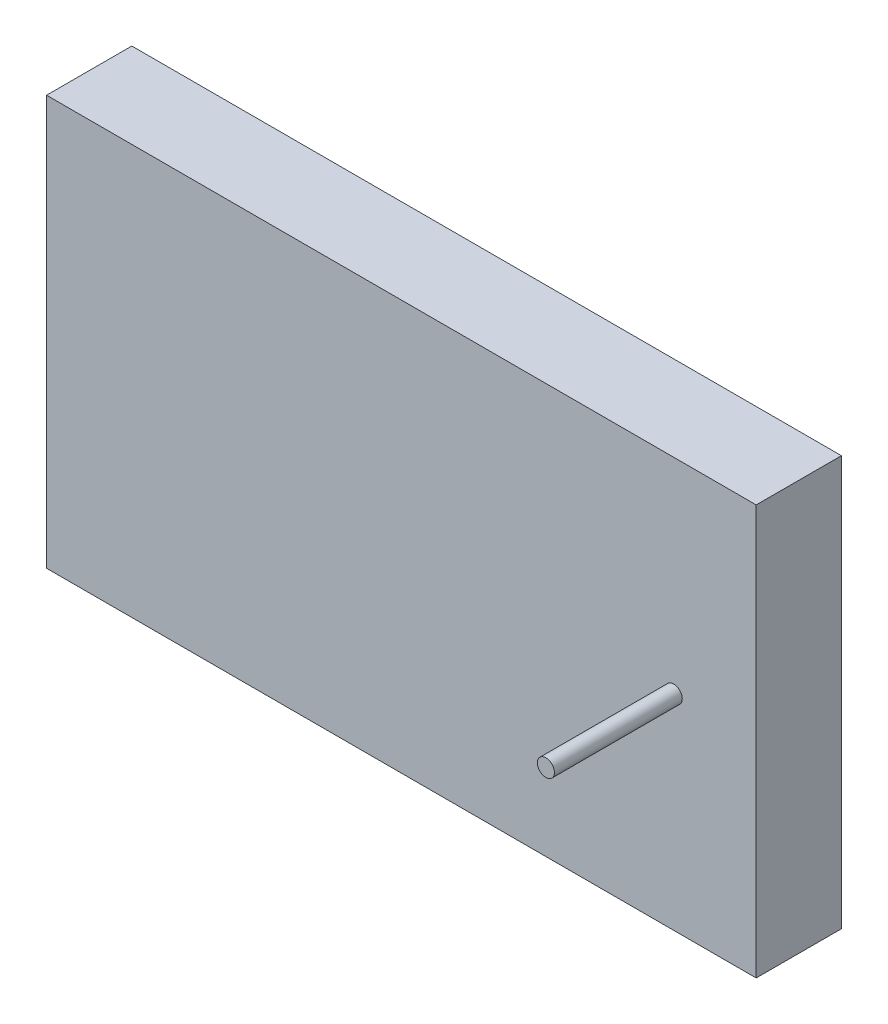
ISO-10303-21;
HEADER;
FILE_DESCRIPTION(('STEP AP214'),'2;1');
FILE_NAME('part.step','',(''),(''),'','','');
FILE_SCHEMA(('AUTOMOTIVE_DESIGN { 1 0 10303 214 1 1 1 1 }'));
ENDSEC;
DATA;
#1=APPLICATION_CONTEXT('core data for automotive mechanical design processes');
#2=APPLICATION_PROTOCOL_DEFINITION('international standard','automotive_design',2000,#1);
#3=PRODUCT_CONTEXT('',#1,'mechanical');
#4=PRODUCT('Part','Part','',(#3));
#5=PRODUCT_RELATED_PRODUCT_CATEGORY('part','',(#4));
#6=PRODUCT_DEFINITION_FORMATION('','',#4);
#7=PRODUCT_DEFINITION_CONTEXT('part definition',#1,'design');
#8=PRODUCT_DEFINITION('design','',#6,#7);
#9=PRODUCT_DEFINITION_SHAPE('','',#8);
#10=(LENGTH_UNIT() NAMED_UNIT(*) SI_UNIT(.MILLI.,.METRE.));
#11=(NAMED_UNIT(*) PLANE_ANGLE_UNIT() SI_UNIT($,.RADIAN.));
#12=(NAMED_UNIT(*) SI_UNIT($,.STERADIAN.) SOLID_ANGLE_UNIT());
#13=UNCERTAINTY_MEASURE_WITH_UNIT(LENGTH_MEASURE(1.E-05),#10,'distance_accuracy_value','');
#14=(GEOMETRIC_REPRESENTATION_CONTEXT(3) GLOBAL_UNCERTAINTY_ASSIGNED_CONTEXT((#13)) GLOBAL_UNIT_ASSIGNED_CONTEXT((#10,
#11,#12)) REPRESENTATION_CONTEXT('',''));
#15=CARTESIAN_POINT('',(0.,0.,0.));
#16=DIRECTION('',(0.,0.,1.));
#17=DIRECTION('',(1.,0.,0.));
#18=AXIS2_PLACEMENT_3D('',#15,#16,#17);
#19=CARTESIAN_POINT('',(73.5925749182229,24.0390153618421,33.1285204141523));
#20=DIRECTION('',(0.,0.,1.));
#21=DIRECTION('',(1.,0.,0.));
#22=AXIS2_PLACEMENT_3D('',#19,#20,#21);
#23=CYLINDRICAL_SURFACE('',#22,1.);
#24=CARTESIAN_POINT('',(73.5925749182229,24.0390153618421,25.));
#25=DIRECTION('',(0.,0.,1.));
#26=DIRECTION('',(1.,0.,0.));
#27=AXIS2_PLACEMENT_3D('',#24,#25,#26);
#28=CIRCLE('',#27,1.);
#29=CARTESIAN_POINT('',(74.5925749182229,24.0390153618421,25.));
#30=VERTEX_POINT('',#29);
#31=EDGE_CURVE('E11',#30,#30,#28,.T.);
#32=ORIENTED_EDGE('',*,*,#31,.F.);
#33=EDGE_LOOP('',(#32));
#34=FACE_BOUND('',#33,.T.);
#35=CARTESIAN_POINT('',(73.5925749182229,24.0390153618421,10.));
#36=DIRECTION('',(0.,0.,-1.));
#37=DIRECTION('',(-1.,0.,0.));
#38=AXIS2_PLACEMENT_3D('',#35,#36,#37);
#39=CIRCLE('',#38,1.);
#40=CARTESIAN_POINT('',(72.5925749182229,24.0390153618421,10.));
#41=VERTEX_POINT('',#40);
#42=EDGE_CURVE('E37',#41,#41,#39,.F.);
#43=ORIENTED_EDGE('',*,*,#42,.T.);
#44=EDGE_LOOP('',(#43));
#45=FACE_BOUND('',#44,.T.);
#46=ADVANCED_FACE('F33',(#34,#45),#23,.T.);
#47=CARTESIAN_POINT('',(74.5925749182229,24.0390153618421,25.));
#48=DIRECTION('',(0.,0.,1.));
#49=DIRECTION('',(1.,0.,0.));
#50=AXIS2_PLACEMENT_3D('',#47,#48,#49);
#51=PLANE('',#50);
#52=ORIENTED_EDGE('',*,*,#31,.T.);
#53=EDGE_LOOP('',(#52));
#54=FACE_BOUND('',#53,.T.);
#55=ADVANCED_FACE('F123',(#54),#51,.T.);
#56=CARTESIAN_POINT('',(0.,0.,10.));
#57=DIRECTION('',(1.,0.,0.));
#58=DIRECTION('',(0.,0.,-1.));
#59=AXIS2_PLACEMENT_3D('',#56,#57,#58);
#60=PLANE('',#59);
#61=DIRECTION('',(0.,-1.,0.));
#62=VECTOR('',#61,1.);
#63=CARTESIAN_POINT('',(0.,0.,0.));
#64=LINE('',#63,#62);
#65=CARTESIAN_POINT('',(0.,48.0780307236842,0.));
#66=VERTEX_POINT('',#65);
#67=CARTESIAN_POINT('',(0.,0.,0.));
#68=VERTEX_POINT('',#67);
#69=EDGE_CURVE('E101',#66,#68,#64,.T.);
#70=ORIENTED_EDGE('',*,*,#69,.T.);
#71=DIRECTION('',(0.,0.,-1.));
#72=VECTOR('',#71,1.);
#73=CARTESIAN_POINT('',(0.,0.,10.));
#74=LINE('',#73,#72);
#75=CARTESIAN_POINT('',(0.,0.,10.));
#76=VERTEX_POINT('',#75);
#77=EDGE_CURVE('E92',#76,#68,#74,.T.);
#78=ORIENTED_EDGE('',*,*,#77,.F.);
#79=DIRECTION('',(0.,-1.,0.));
#80=VECTOR('',#79,1.);
#81=CARTESIAN_POINT('',(0.,0.,10.));
#82=LINE('',#81,#80);
#83=CARTESIAN_POINT('',(0.,48.0780307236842,10.));
#84=VERTEX_POINT('',#83);
#85=EDGE_CURVE('E86',#84,#76,#82,.T.);
#86=ORIENTED_EDGE('',*,*,#85,.F.);
#87=DIRECTION('',(0.,0.,-1.));
#88=VECTOR('',#87,1.);
#89=CARTESIAN_POINT('',(0.,48.0780307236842,10.));
#90=LINE('',#89,#88);
#91=EDGE_CURVE('E97',#84,#66,#90,.T.);
#92=ORIENTED_EDGE('',*,*,#91,.T.);
#93=EDGE_LOOP('',(#70,#78,#86,#92));
#94=FACE_BOUND('',#93,.T.);
#95=ADVANCED_FACE('F128',(#94),#60,.F.);
#96=CARTESIAN_POINT('',(0.,0.,10.));
#97=DIRECTION('',(0.,1.,0.));
#98=DIRECTION('',(0.,0.,1.));
#99=AXIS2_PLACEMENT_3D('',#96,#97,#98);
#100=PLANE('',#99);
#101=DIRECTION('',(1.,0.,0.));
#102=VECTOR('',#101,1.);
#103=CARTESIAN_POINT('',(0.,0.,0.));
#104=LINE('',#103,#102);
#105=CARTESIAN_POINT('',(83.2691040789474,0.,0.));
#106=VERTEX_POINT('',#105);
#107=EDGE_CURVE('E91',#68,#106,#104,.T.);
#108=ORIENTED_EDGE('',*,*,#107,.T.);
#109=DIRECTION('',(0.,0.,-1.));
#110=VECTOR('',#109,1.);
#111=CARTESIAN_POINT('',(83.2691040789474,0.,10.));
#112=LINE('',#111,#110);
#113=CARTESIAN_POINT('',(83.2691040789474,0.,10.));
#114=VERTEX_POINT('',#113);
#115=EDGE_CURVE('E89',#114,#106,#112,.T.);
#116=ORIENTED_EDGE('',*,*,#115,.F.);
#117=DIRECTION('',(1.,0.,0.));
#118=VECTOR('',#117,1.);
#119=CARTESIAN_POINT('',(0.,0.,10.));
#120=LINE('',#119,#118);
#121=EDGE_CURVE('E81',#76,#114,#120,.T.);
#122=ORIENTED_EDGE('',*,*,#121,.F.);
#123=ORIENTED_EDGE('',*,*,#77,.T.);
#124=EDGE_LOOP('',(#108,#116,#122,#123));
#125=FACE_BOUND('',#124,.T.);
#126=ADVANCED_FACE('F90',(#125),#100,.F.);
#127=CARTESIAN_POINT('',(83.2691040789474,0.,10.));
#128=DIRECTION('',(-1.,0.,0.));
#129=DIRECTION('',(0.,0.,1.));
#130=AXIS2_PLACEMENT_3D('',#127,#128,#129);
#131=PLANE('',#130);
#132=DIRECTION('',(0.,1.,0.));
#133=VECTOR('',#132,1.);
#134=CARTESIAN_POINT('',(83.2691040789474,0.,0.));
#135=LINE('',#134,#133);
#136=CARTESIAN_POINT('',(83.2691040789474,48.0780307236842,0.));
#137=VERTEX_POINT('',#136);
#138=EDGE_CURVE('E67',#106,#137,#135,.T.);
#139=ORIENTED_EDGE('',*,*,#138,.T.);
#140=DIRECTION('',(0.,0.,-1.));
#141=VECTOR('',#140,1.);
#142=CARTESIAN_POINT('',(83.2691040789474,48.0780307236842,10.));
#143=LINE('',#142,#141);
#144=CARTESIAN_POINT('',(83.2691040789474,48.0780307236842,10.));
#145=VERTEX_POINT('',#144);
#146=EDGE_CURVE('E93',#145,#137,#143,.T.);
#147=ORIENTED_EDGE('',*,*,#146,.F.);
#148=DIRECTION('',(0.,1.,0.));
#149=VECTOR('',#148,1.);
#150=CARTESIAN_POINT('',(83.2691040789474,0.,10.));
#151=LINE('',#150,#149);
#152=EDGE_CURVE('E84',#114,#145,#151,.T.);
#153=ORIENTED_EDGE('',*,*,#152,.F.);
#154=ORIENTED_EDGE('',*,*,#115,.T.);
#155=EDGE_LOOP('',(#139,#147,#153,#154));
#156=FACE_BOUND('',#155,.T.);
#157=ADVANCED_FACE('F95',(#156),#131,.F.);
#158=CARTESIAN_POINT('',(0.,48.0780307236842,10.));
#159=DIRECTION('',(0.,-1.,0.));
#160=DIRECTION('',(0.,0.,-1.));
#161=AXIS2_PLACEMENT_3D('',#158,#159,#160);
#162=PLANE('',#161);
#163=DIRECTION('',(-1.,0.,0.));
#164=VECTOR('',#163,1.);
#165=CARTESIAN_POINT('',(0.,48.0780307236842,0.));
#166=LINE('',#165,#164);
#167=EDGE_CURVE('E73',#137,#66,#166,.T.);
#168=ORIENTED_EDGE('',*,*,#167,.T.);
#169=ORIENTED_EDGE('',*,*,#91,.F.);
#170=DIRECTION('',(-1.,0.,0.));
#171=VECTOR('',#170,1.);
#172=CARTESIAN_POINT('',(0.,48.0780307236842,10.));
#173=LINE('',#172,#171);
#174=EDGE_CURVE('E50',#145,#84,#173,.T.);
#175=ORIENTED_EDGE('',*,*,#174,.F.);
#176=ORIENTED_EDGE('',*,*,#146,.T.);
#177=EDGE_LOOP('',(#168,#169,#175,#176));
#178=FACE_BOUND('',#177,.T.);
#179=ADVANCED_FACE('F114',(#178),#162,.F.);
#180=CARTESIAN_POINT('',(0.,48.0780307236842,10.));
#181=DIRECTION('',(0.,0.,-1.));
#182=DIRECTION('',(-1.,0.,0.));
#183=AXIS2_PLACEMENT_3D('',#180,#181,#182);
#184=PLANE('',#183);
#185=ORIENTED_EDGE('',*,*,#42,.F.);
#186=EDGE_LOOP('',(#185));
#187=FACE_BOUND('',#186,.T.);
#188=ORIENTED_EDGE('',*,*,#85,.T.);
#189=ORIENTED_EDGE('',*,*,#121,.T.);
#190=ORIENTED_EDGE('',*,*,#152,.T.);
#191=ORIENTED_EDGE('',*,*,#174,.T.);
#192=EDGE_LOOP('',(#188,#189,#190,#191));
#193=FACE_BOUND('',#192,.T.);
#194=ADVANCED_FACE('F82',(#187,#193),#184,.F.);
#195=CARTESIAN_POINT('',(73.5925749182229,24.0390153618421,0.));
#196=DIRECTION('',(0.,0.,-1.));
#197=DIRECTION('',(-1.,0.,0.));
#198=AXIS2_PLACEMENT_3D('',#195,#196,#197);
#199=PLANE('',#198);
#200=ORIENTED_EDGE('',*,*,#69,.F.);
#201=ORIENTED_EDGE('',*,*,#167,.F.);
#202=ORIENTED_EDGE('',*,*,#138,.F.);
#203=ORIENTED_EDGE('',*,*,#107,.F.);
#204=EDGE_LOOP('',(#200,#201,#202,#203));
#205=FACE_BOUND('',#204,.T.);
#206=ADVANCED_FACE('F35',(#205),#199,.T.);
#207=CLOSED_SHELL('',(#46,#55,#95,#126,#157,#179,#194,#206));
#208=MANIFOLD_SOLID_BREP('B2',#207);
#209=ADVANCED_BREP_SHAPE_REPRESENTATION('',(#18,#208),#14);
#210=SHAPE_DEFINITION_REPRESENTATION(#9,#209);
ENDSEC;
END-ISO-10303-21;
